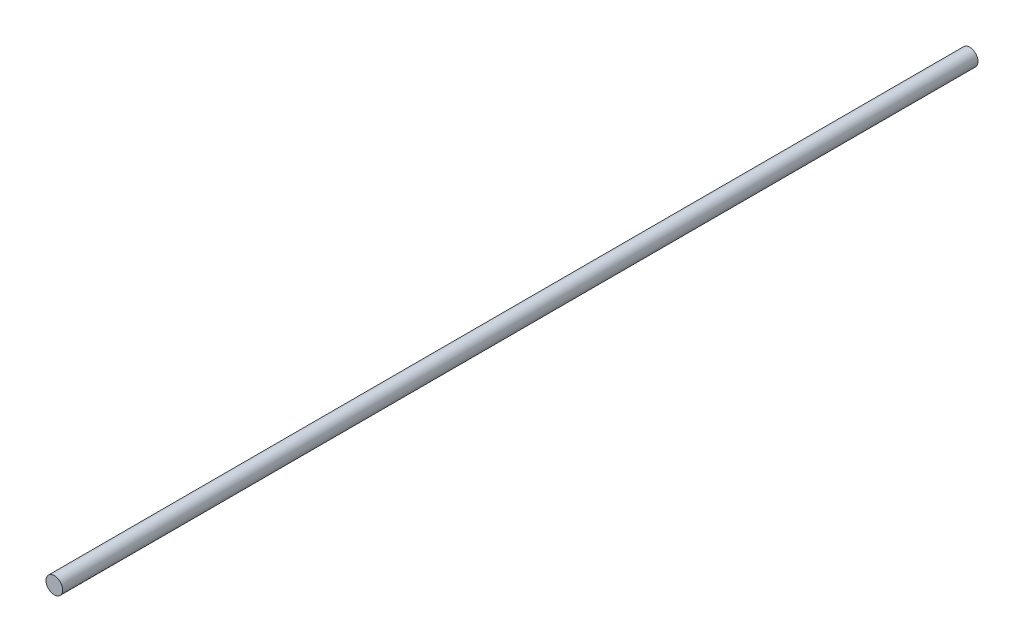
from build123d import *

# Parameters (mm, degrees)
SKETCH1_R           = 30
BOSS_EXTRUDE1_DEPTH = 3300


with BuildPart() as part:
    # Sketch1 → Boss-Extrude1 (new body)
    with BuildSketch(Plane.XY):
        Circle(SKETCH1_R)
    extrude(amount=-BOSS_EXTRUDE1_DEPTH)


solid = part.part
